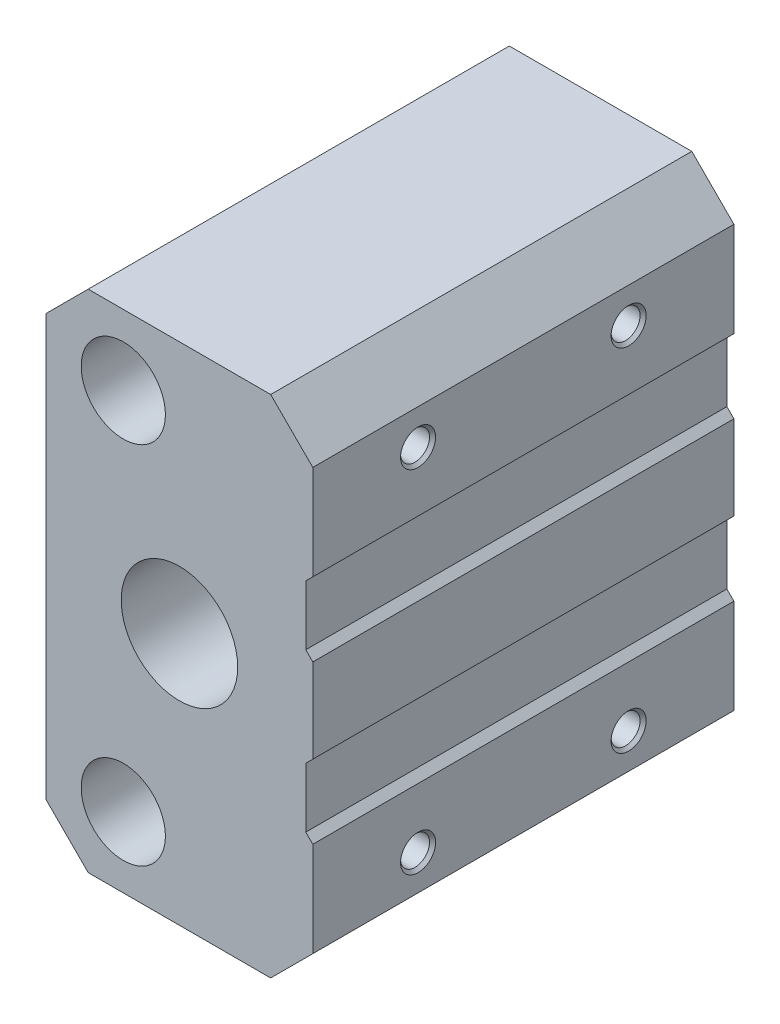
ISO-10303-21;
HEADER;
FILE_DESCRIPTION(('STEP AP214'),'2;1');
FILE_NAME('part.step','',(''),(''),'','','');
FILE_SCHEMA(('AUTOMOTIVE_DESIGN { 1 0 10303 214 1 1 1 1 }'));
ENDSEC;
DATA;
#1=APPLICATION_CONTEXT('core data for automotive mechanical design processes');
#2=APPLICATION_PROTOCOL_DEFINITION('international standard','automotive_design',2000,#1);
#3=PRODUCT_CONTEXT('',#1,'mechanical');
#4=PRODUCT('Part','Part','',(#3));
#5=PRODUCT_RELATED_PRODUCT_CATEGORY('part','',(#4));
#6=PRODUCT_DEFINITION_FORMATION('','',#4);
#7=PRODUCT_DEFINITION_CONTEXT('part definition',#1,'design');
#8=PRODUCT_DEFINITION('design','',#6,#7);
#9=PRODUCT_DEFINITION_SHAPE('','',#8);
#10=(LENGTH_UNIT() NAMED_UNIT(*) SI_UNIT(.MILLI.,.METRE.));
#11=(NAMED_UNIT(*) PLANE_ANGLE_UNIT() SI_UNIT($,.RADIAN.));
#12=(NAMED_UNIT(*) SI_UNIT($,.STERADIAN.) SOLID_ANGLE_UNIT());
#13=UNCERTAINTY_MEASURE_WITH_UNIT(LENGTH_MEASURE(1.E-05),#10,'distance_accuracy_value','');
#14=(GEOMETRIC_REPRESENTATION_CONTEXT(3) GLOBAL_UNCERTAINTY_ASSIGNED_CONTEXT((#13)) GLOBAL_UNIT_ASSIGNED_CONTEXT((#10,
#11,#12)) REPRESENTATION_CONTEXT('',''));
#15=CARTESIAN_POINT('',(0.,0.,0.));
#16=DIRECTION('',(0.,0.,1.));
#17=DIRECTION('',(1.,0.,0.));
#18=AXIS2_PLACEMENT_3D('',#15,#16,#17);
#19=CARTESIAN_POINT('',(10.9999999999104,-25.,-15.));
#20=DIRECTION('',(1.,0.,0.));
#21=DIRECTION('',(0.,0.,-1.));
#22=AXIS2_PLACEMENT_3D('',#19,#20,#21);
#23=CONICAL_SURFACE('',#22,2.06699999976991,1.04719755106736);
#24=CARTESIAN_POINT('',(9.80661699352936,-25.,-15.0000000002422));
#25=VERTEX_POINT('',#24);
#26=VERTEX_LOOP('',#25);
#27=FACE_BOUND('',#26,.T.);
#28=CARTESIAN_POINT('',(10.9999999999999,-25.,-15.));
#29=DIRECTION('',(-1.,0.,0.));
#30=DIRECTION('',(0.,0.,1.));
#31=AXIS2_PLACEMENT_3D('',#28,#29,#30);
#32=CIRCLE('',#31,2.067);
#33=CARTESIAN_POINT('',(10.9999999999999,-25.,-12.933));
#34=VERTEX_POINT('',#33);
#35=EDGE_CURVE('E144',#34,#34,#32,.F.);
#36=ORIENTED_EDGE('',*,*,#35,.T.);
#37=EDGE_LOOP('',(#36));
#38=FACE_BOUND('',#37,.T.);
#39=ADVANCED_FACE('F17',(#27,#38),#23,.F.);
#40=CARTESIAN_POINT('',(11.0000000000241,-25.,-45.));
#41=DIRECTION('',(1.,0.,0.));
#42=DIRECTION('',(0.,0.,-1.));
#43=AXIS2_PLACEMENT_3D('',#40,#41,#42);
#44=CONICAL_SURFACE('',#43,2.06699999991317,1.04719755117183);
#45=CARTESIAN_POINT('',(9.80661699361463,-25.,-44.9999999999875));
#46=VERTEX_POINT('',#45);
#47=VERTEX_LOOP('',#46);
#48=FACE_BOUND('',#47,.T.);
#49=CARTESIAN_POINT('',(10.9999999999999,-25.,-45.));
#50=DIRECTION('',(-1.,0.,0.));
#51=DIRECTION('',(0.,0.,1.));
#52=AXIS2_PLACEMENT_3D('',#49,#50,#51);
#53=CIRCLE('',#52,2.067);
#54=CARTESIAN_POINT('',(10.9999999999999,-25.,-42.933));
#55=VERTEX_POINT('',#54);
#56=EDGE_CURVE('E146',#55,#55,#53,.F.);
#57=ORIENTED_EDGE('',*,*,#56,.T.);
#58=EDGE_LOOP('',(#57));
#59=FACE_BOUND('',#58,.T.);
#60=ADVANCED_FACE('F141',(#48,#59),#44,.F.);
#61=CARTESIAN_POINT('',(11.0000000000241,25.,-15.));
#62=DIRECTION('',(1.,0.,0.));
#63=DIRECTION('',(0.,0.,-1.));
#64=AXIS2_PLACEMENT_3D('',#61,#62,#63);
#65=CONICAL_SURFACE('',#64,2.06699999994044,1.04719755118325);
#66=CARTESIAN_POINT('',(9.80661699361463,25.,-14.9999999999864));
#67=VERTEX_POINT('',#66);
#68=VERTEX_LOOP('',#67);
#69=FACE_BOUND('',#68,.T.);
#70=CARTESIAN_POINT('',(10.9999999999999,25.,-15.));
#71=DIRECTION('',(-1.,0.,0.));
#72=DIRECTION('',(0.,0.,1.));
#73=AXIS2_PLACEMENT_3D('',#70,#71,#72);
#74=CIRCLE('',#73,2.067);
#75=CARTESIAN_POINT('',(10.9999999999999,25.,-12.933));
#76=VERTEX_POINT('',#75);
#77=EDGE_CURVE('E149',#76,#76,#74,.F.);
#78=ORIENTED_EDGE('',*,*,#77,.T.);
#79=EDGE_LOOP('',(#78));
#80=FACE_BOUND('',#79,.T.);
#81=ADVANCED_FACE('F237',(#69,#80),#65,.F.);
#82=CARTESIAN_POINT('',(11.0000000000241,25.,-45.));
#83=DIRECTION('',(1.,0.,0.));
#84=DIRECTION('',(0.,0.,-1.));
#85=AXIS2_PLACEMENT_3D('',#82,#83,#84);
#86=CONICAL_SURFACE('',#85,2.06699999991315,1.04719755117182);
#87=CARTESIAN_POINT('',(9.80661699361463,25.,-44.9999999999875));
#88=VERTEX_POINT('',#87);
#89=VERTEX_LOOP('',#88);
#90=FACE_BOUND('',#89,.T.);
#91=CARTESIAN_POINT('',(10.9999999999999,25.,-45.));
#92=DIRECTION('',(-1.,0.,0.));
#93=DIRECTION('',(0.,0.,1.));
#94=AXIS2_PLACEMENT_3D('',#91,#92,#93);
#95=CIRCLE('',#94,2.067);
#96=CARTESIAN_POINT('',(10.9999999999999,25.,-42.933));
#97=VERTEX_POINT('',#96);
#98=EDGE_CURVE('E232',#97,#97,#95,.F.);
#99=ORIENTED_EDGE('',*,*,#98,.T.);
#100=EDGE_LOOP('',(#99));
#101=FACE_BOUND('',#100,.T.);
#102=ADVANCED_FACE('F365',(#90,#101),#86,.F.);
#103=CARTESIAN_POINT('',(19.,-25.,-15.));
#104=DIRECTION('',(-1.,0.,0.));
#105=DIRECTION('',(0.,0.,1.));
#106=AXIS2_PLACEMENT_3D('',#103,#104,#105);
#107=CYLINDRICAL_SURFACE('',#106,2.067);
#108=CARTESIAN_POINT('',(18.5669999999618,-25.,-15.));
#109=DIRECTION('',(1.,0.,0.));
#110=DIRECTION('',(0.,0.,-1.));
#111=AXIS2_PLACEMENT_3D('',#108,#109,#110);
#112=CIRCLE('',#111,2.06699999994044);
#113=CARTESIAN_POINT('',(18.5669999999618,-25.,-17.0669999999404));
#114=VERTEX_POINT('',#113);
#115=EDGE_CURVE('E229',#114,#114,#112,.T.);
#116=ORIENTED_EDGE('',*,*,#115,.T.);
#117=EDGE_LOOP('',(#116));
#118=FACE_BOUND('',#117,.T.);
#119=ORIENTED_EDGE('',*,*,#35,.F.);
#120=EDGE_LOOP('',(#119));
#121=FACE_BOUND('',#120,.T.);
#122=ADVANCED_FACE('F253',(#118,#121),#107,.F.);
#123=CARTESIAN_POINT('',(19.,-25.,-45.));
#124=DIRECTION('',(-1.,0.,0.));
#125=DIRECTION('',(0.,0.,1.));
#126=AXIS2_PLACEMENT_3D('',#123,#124,#125);
#127=CYLINDRICAL_SURFACE('',#126,2.067);
#128=CARTESIAN_POINT('',(18.5669999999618,-25.,-45.));
#129=DIRECTION('',(1.,0.,0.));
#130=DIRECTION('',(0.,0.,-1.));
#131=AXIS2_PLACEMENT_3D('',#128,#129,#130);
#132=CIRCLE('',#131,2.06699999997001);
#133=CARTESIAN_POINT('',(18.5669999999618,-25.,-47.06699999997));
#134=VERTEX_POINT('',#133);
#135=EDGE_CURVE('E222',#134,#134,#132,.T.);
#136=ORIENTED_EDGE('',*,*,#135,.T.);
#137=EDGE_LOOP('',(#136));
#138=FACE_BOUND('',#137,.T.);
#139=ORIENTED_EDGE('',*,*,#56,.F.);
#140=EDGE_LOOP('',(#139));
#141=FACE_BOUND('',#140,.T.);
#142=ADVANCED_FACE('F242',(#138,#141),#127,.F.);
#143=CARTESIAN_POINT('',(19.,25.,-15.));
#144=DIRECTION('',(-1.,0.,0.));
#145=DIRECTION('',(0.,0.,1.));
#146=AXIS2_PLACEMENT_3D('',#143,#144,#145);
#147=CYLINDRICAL_SURFACE('',#146,2.067);
#148=CARTESIAN_POINT('',(18.5669999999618,25.,-15.));
#149=DIRECTION('',(1.,0.,0.));
#150=DIRECTION('',(0.,0.,-1.));
#151=AXIS2_PLACEMENT_3D('',#148,#149,#150);
#152=CIRCLE('',#151,2.06699999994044);
#153=CARTESIAN_POINT('',(18.5669999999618,25.,-17.0669999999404));
#154=VERTEX_POINT('',#153);
#155=EDGE_CURVE('E209',#154,#154,#152,.T.);
#156=ORIENTED_EDGE('',*,*,#155,.T.);
#157=EDGE_LOOP('',(#156));
#158=FACE_BOUND('',#157,.T.);
#159=ORIENTED_EDGE('',*,*,#77,.F.);
#160=EDGE_LOOP('',(#159));
#161=FACE_BOUND('',#160,.T.);
#162=ADVANCED_FACE('F239',(#158,#161),#147,.F.);
#163=CARTESIAN_POINT('',(19.,25.,-45.));
#164=DIRECTION('',(-1.,0.,0.));
#165=DIRECTION('',(0.,0.,1.));
#166=AXIS2_PLACEMENT_3D('',#163,#164,#165);
#167=CYLINDRICAL_SURFACE('',#166,2.067);
#168=CARTESIAN_POINT('',(18.5669999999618,25.,-45.));
#169=DIRECTION('',(1.,0.,0.));
#170=DIRECTION('',(0.,0.,-1.));
#171=AXIS2_PLACEMENT_3D('',#168,#169,#170);
#172=CIRCLE('',#171,2.06699999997);
#173=CARTESIAN_POINT('',(18.5669999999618,25.,-47.06699999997));
#174=VERTEX_POINT('',#173);
#175=EDGE_CURVE('E206',#174,#174,#172,.T.);
#176=ORIENTED_EDGE('',*,*,#175,.T.);
#177=EDGE_LOOP('',(#176));
#178=FACE_BOUND('',#177,.T.);
#179=ORIENTED_EDGE('',*,*,#98,.F.);
#180=EDGE_LOOP('',(#179));
#181=FACE_BOUND('',#180,.T.);
#182=ADVANCED_FACE('F241',(#178,#181),#167,.F.);
#183=CARTESIAN_POINT('',(19.0000000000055,-25.,-15.));
#184=DIRECTION('',(1.,0.,0.));
#185=DIRECTION('',(0.,0.,-1.));
#186=AXIS2_PLACEMENT_3D('',#183,#184,#185);
#187=CONICAL_SURFACE('',#186,2.49999999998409,0.785398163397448);
#188=ORIENTED_EDGE('',*,*,#115,.F.);
#189=EDGE_LOOP('',(#188));
#190=FACE_BOUND('',#189,.T.);
#191=CARTESIAN_POINT('',(19.0000000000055,-25.,-15.));
#192=DIRECTION('',(1.,0.,0.));
#193=DIRECTION('',(0.,0.,-1.));
#194=AXIS2_PLACEMENT_3D('',#191,#192,#193);
#195=CIRCLE('',#194,2.49999999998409);
#196=CARTESIAN_POINT('',(19.0000000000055,-25.,-17.4999999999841));
#197=VERTEX_POINT('',#196);
#198=EDGE_CURVE('E20',#197,#197,#195,.F.);
#199=ORIENTED_EDGE('',*,*,#198,.F.);
#200=EDGE_LOOP('',(#199));
#201=FACE_BOUND('',#200,.T.);
#202=ADVANCED_FACE('F250',(#190,#201),#187,.F.);
#203=CARTESIAN_POINT('',(19.0000000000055,-25.,-45.));
#204=DIRECTION('',(1.,0.,0.));
#205=DIRECTION('',(0.,0.,-1.));
#206=AXIS2_PLACEMENT_3D('',#203,#204,#205);
#207=CONICAL_SURFACE('',#206,2.50000000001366,0.785398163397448);
#208=ORIENTED_EDGE('',*,*,#135,.F.);
#209=EDGE_LOOP('',(#208));
#210=FACE_BOUND('',#209,.T.);
#211=CARTESIAN_POINT('',(19.0000000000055,-25.,-45.));
#212=DIRECTION('',(1.,0.,0.));
#213=DIRECTION('',(0.,0.,-1.));
#214=AXIS2_PLACEMENT_3D('',#211,#212,#213);
#215=CIRCLE('',#214,2.50000000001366);
#216=CARTESIAN_POINT('',(19.0000000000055,-25.,-47.5000000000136));
#217=VERTEX_POINT('',#216);
#218=EDGE_CURVE('E183',#217,#217,#215,.F.);
#219=ORIENTED_EDGE('',*,*,#218,.F.);
#220=EDGE_LOOP('',(#219));
#221=FACE_BOUND('',#220,.T.);
#222=ADVANCED_FACE('F349',(#210,#221),#207,.F.);
#223=CARTESIAN_POINT('',(19.,-16.5,-60.));
#224=DIRECTION('',(0.707106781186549,0.707106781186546,0.));
#225=DIRECTION('',(-0.707106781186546,0.707106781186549,0.));
#226=AXIS2_PLACEMENT_3D('',#223,#224,#225);
#227=PLANE('',#226);
#228=DIRECTION('',(-0.707106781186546,0.707106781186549,0.));
#229=VECTOR('',#228,1.);
#230=CARTESIAN_POINT('',(19.,-16.5,-60.));
#231=LINE('',#230,#229);
#232=CARTESIAN_POINT('',(19.,-16.5,-60.));
#233=VERTEX_POINT('',#232);
#234=CARTESIAN_POINT('',(18.,-15.5,-60.));
#235=VERTEX_POINT('',#234);
#236=EDGE_CURVE('E218',#233,#235,#231,.T.);
#237=ORIENTED_EDGE('',*,*,#236,.T.);
#238=DIRECTION('',(0.,0.,-1.));
#239=VECTOR('',#238,1.);
#240=CARTESIAN_POINT('',(18.,-15.5,-60.));
#241=LINE('',#240,#239);
#242=CARTESIAN_POINT('',(18.,-15.5,0.));
#243=VERTEX_POINT('',#242);
#244=EDGE_CURVE('E185',#243,#235,#241,.T.);
#245=ORIENTED_EDGE('',*,*,#244,.F.);
#246=DIRECTION('',(-0.707106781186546,0.707106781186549,0.));
#247=VECTOR('',#246,1.);
#248=CARTESIAN_POINT('',(19.,-16.5,0.));
#249=LINE('',#248,#247);
#250=CARTESIAN_POINT('',(19.,-16.5,0.));
#251=VERTEX_POINT('',#250);
#252=EDGE_CURVE('E220',#243,#251,#249,.F.);
#253=ORIENTED_EDGE('',*,*,#252,.T.);
#254=DIRECTION('',(0.,0.,-1.));
#255=VECTOR('',#254,1.);
#256=CARTESIAN_POINT('',(19.,-16.5,-60.));
#257=LINE('',#256,#255);
#258=EDGE_CURVE('E186',#233,#251,#257,.F.);
#259=ORIENTED_EDGE('',*,*,#258,.F.);
#260=EDGE_LOOP('',(#237,#245,#253,#259));
#261=FACE_BOUND('',#260,.T.);
#262=ADVANCED_FACE('F345',(#261),#227,.T.);
#263=CARTESIAN_POINT('',(18.,-7.,-60.));
#264=DIRECTION('',(0.707106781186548,-0.707106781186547,0.));
#265=DIRECTION('',(0.707106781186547,0.707106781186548,0.));
#266=AXIS2_PLACEMENT_3D('',#263,#264,#265);
#267=PLANE('',#266);
#268=DIRECTION('',(0.707106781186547,0.707106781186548,0.));
#269=VECTOR('',#268,1.);
#270=CARTESIAN_POINT('',(18.,-7.,-60.));
#271=LINE('',#270,#269);
#272=CARTESIAN_POINT('',(18.,-7.,-60.));
#273=VERTEX_POINT('',#272);
#274=CARTESIAN_POINT('',(19.,-6.,-60.));
#275=VERTEX_POINT('',#274);
#276=EDGE_CURVE('E214',#273,#275,#271,.T.);
#277=ORIENTED_EDGE('',*,*,#276,.T.);
#278=DIRECTION('',(0.,0.,-1.));
#279=VECTOR('',#278,1.);
#280=CARTESIAN_POINT('',(19.,-6.,-60.));
#281=LINE('',#280,#279);
#282=CARTESIAN_POINT('',(19.,-6.,0.));
#283=VERTEX_POINT('',#282);
#284=EDGE_CURVE('E685',#283,#275,#281,.T.);
#285=ORIENTED_EDGE('',*,*,#284,.F.);
#286=DIRECTION('',(0.707106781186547,0.707106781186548,0.));
#287=VECTOR('',#286,1.);
#288=CARTESIAN_POINT('',(18.,-7.,0.));
#289=LINE('',#288,#287);
#290=CARTESIAN_POINT('',(18.,-7.,0.));
#291=VERTEX_POINT('',#290);
#292=EDGE_CURVE('E216',#283,#291,#289,.F.);
#293=ORIENTED_EDGE('',*,*,#292,.T.);
#294=DIRECTION('',(0.,0.,-1.));
#295=VECTOR('',#294,1.);
#296=CARTESIAN_POINT('',(18.,-7.,-60.));
#297=LINE('',#296,#295);
#298=EDGE_CURVE('E190',#273,#291,#297,.F.);
#299=ORIENTED_EDGE('',*,*,#298,.F.);
#300=EDGE_LOOP('',(#277,#285,#293,#299));
#301=FACE_BOUND('',#300,.T.);
#302=ADVANCED_FACE('F341',(#301),#267,.T.);
#303=CARTESIAN_POINT('',(19.,6.,-60.));
#304=DIRECTION('',(0.707106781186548,0.707106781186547,0.));
#305=DIRECTION('',(-0.707106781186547,0.707106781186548,0.));
#306=AXIS2_PLACEMENT_3D('',#303,#304,#305);
#307=PLANE('',#306);
#308=DIRECTION('',(-0.707106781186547,0.707106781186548,0.));
#309=VECTOR('',#308,1.);
#310=CARTESIAN_POINT('',(19.,6.,-60.));
#311=LINE('',#310,#309);
#312=CARTESIAN_POINT('',(19.,6.,-60.));
#313=VERTEX_POINT('',#312);
#314=CARTESIAN_POINT('',(18.,7.,-60.));
#315=VERTEX_POINT('',#314);
#316=EDGE_CURVE('E210',#313,#315,#311,.T.);
#317=ORIENTED_EDGE('',*,*,#316,.T.);
#318=DIRECTION('',(0.,0.,-1.));
#319=VECTOR('',#318,1.);
#320=CARTESIAN_POINT('',(18.,7.,-60.));
#321=LINE('',#320,#319);
#322=CARTESIAN_POINT('',(18.,7.,0.));
#323=VERTEX_POINT('',#322);
#324=EDGE_CURVE('E679',#323,#315,#321,.T.);
#325=ORIENTED_EDGE('',*,*,#324,.F.);
#326=DIRECTION('',(-0.707106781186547,0.707106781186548,0.));
#327=VECTOR('',#326,1.);
#328=CARTESIAN_POINT('',(19.,6.,0.));
#329=LINE('',#328,#327);
#330=CARTESIAN_POINT('',(19.,6.,0.));
#331=VERTEX_POINT('',#330);
#332=EDGE_CURVE('E212',#323,#331,#329,.F.);
#333=ORIENTED_EDGE('',*,*,#332,.T.);
#334=DIRECTION('',(0.,0.,-1.));
#335=VECTOR('',#334,1.);
#336=CARTESIAN_POINT('',(19.,6.,-60.));
#337=LINE('',#336,#335);
#338=EDGE_CURVE('E682',#313,#331,#337,.F.);
#339=ORIENTED_EDGE('',*,*,#338,.F.);
#340=EDGE_LOOP('',(#317,#325,#333,#339));
#341=FACE_BOUND('',#340,.T.);
#342=ADVANCED_FACE('F337',(#341),#307,.T.);
#343=CARTESIAN_POINT('',(18.9999999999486,25.,-15.));
#344=DIRECTION('',(1.,0.,0.));
#345=DIRECTION('',(0.,0.,-1.));
#346=AXIS2_PLACEMENT_3D('',#343,#344,#345);
#347=CONICAL_SURFACE('',#346,2.49999999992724,0.785398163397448);
#348=ORIENTED_EDGE('',*,*,#155,.F.);
#349=EDGE_LOOP('',(#348));
#350=FACE_BOUND('',#349,.T.);
#351=CARTESIAN_POINT('',(19.0000000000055,25.,-15.));
#352=DIRECTION('',(1.,0.,0.));
#353=DIRECTION('',(0.,0.,-1.));
#354=AXIS2_PLACEMENT_3D('',#351,#352,#353);
#355=CIRCLE('',#354,2.49999999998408);
#356=CARTESIAN_POINT('',(19.0000000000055,25.,-17.4999999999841));
#357=VERTEX_POINT('',#356);
#358=EDGE_CURVE('E180',#357,#357,#355,.F.);
#359=ORIENTED_EDGE('',*,*,#358,.F.);
#360=EDGE_LOOP('',(#359));
#361=FACE_BOUND('',#360,.T.);
#362=ADVANCED_FACE('F333',(#350,#361),#347,.F.);
#363=CARTESIAN_POINT('',(18.,15.5,-60.));
#364=DIRECTION('',(0.707106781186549,-0.707106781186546,0.));
#365=DIRECTION('',(0.707106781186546,0.707106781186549,0.));
#366=AXIS2_PLACEMENT_3D('',#363,#364,#365);
#367=PLANE('',#366);
#368=DIRECTION('',(0.707106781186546,0.707106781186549,0.));
#369=VECTOR('',#368,1.);
#370=CARTESIAN_POINT('',(18.,15.5,-60.));
#371=LINE('',#370,#369);
#372=CARTESIAN_POINT('',(18.,15.5,-60.));
#373=VERTEX_POINT('',#372);
#374=CARTESIAN_POINT('',(19.,16.5,-60.));
#375=VERTEX_POINT('',#374);
#376=EDGE_CURVE('E204',#373,#375,#371,.T.);
#377=ORIENTED_EDGE('',*,*,#376,.T.);
#378=DIRECTION('',(0.,0.,-1.));
#379=VECTOR('',#378,1.);
#380=CARTESIAN_POINT('',(19.,16.5,-60.));
#381=LINE('',#380,#379);
#382=CARTESIAN_POINT('',(19.,16.5,0.));
#383=VERTEX_POINT('',#382);
#384=EDGE_CURVE('E179',#383,#375,#381,.T.);
#385=ORIENTED_EDGE('',*,*,#384,.F.);
#386=DIRECTION('',(0.707106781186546,0.707106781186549,0.));
#387=VECTOR('',#386,1.);
#388=CARTESIAN_POINT('',(18.,15.5,0.));
#389=LINE('',#388,#387);
#390=CARTESIAN_POINT('',(18.,15.5,0.));
#391=VERTEX_POINT('',#390);
#392=EDGE_CURVE('E207',#383,#391,#389,.F.);
#393=ORIENTED_EDGE('',*,*,#392,.T.);
#394=DIRECTION('',(0.,0.,-1.));
#395=VECTOR('',#394,1.);
#396=CARTESIAN_POINT('',(18.,15.5,-60.));
#397=LINE('',#396,#395);
#398=EDGE_CURVE('E182',#373,#391,#397,.F.);
#399=ORIENTED_EDGE('',*,*,#398,.F.);
#400=EDGE_LOOP('',(#377,#385,#393,#399));
#401=FACE_BOUND('',#400,.T.);
#402=ADVANCED_FACE('F329',(#401),#367,.T.);
#403=CARTESIAN_POINT('',(19.0000000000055,25.,-45.));
#404=DIRECTION('',(1.,0.,0.));
#405=DIRECTION('',(0.,0.,-1.));
#406=AXIS2_PLACEMENT_3D('',#403,#404,#405);
#407=CONICAL_SURFACE('',#406,2.50000000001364,0.785398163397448);
#408=ORIENTED_EDGE('',*,*,#175,.F.);
#409=EDGE_LOOP('',(#408));
#410=FACE_BOUND('',#409,.T.);
#411=CARTESIAN_POINT('',(19.0000000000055,25.,-45.));
#412=DIRECTION('',(1.,0.,0.));
#413=DIRECTION('',(0.,0.,-1.));
#414=AXIS2_PLACEMENT_3D('',#411,#412,#413);
#415=CIRCLE('',#414,2.50000000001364);
#416=CARTESIAN_POINT('',(19.0000000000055,25.,-47.5000000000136));
#417=VERTEX_POINT('',#416);
#418=EDGE_CURVE('E175',#417,#417,#415,.F.);
#419=ORIENTED_EDGE('',*,*,#418,.F.);
#420=EDGE_LOOP('',(#419));
#421=FACE_BOUND('',#420,.T.);
#422=ADVANCED_FACE('F325',(#410,#421),#407,.F.);
#423=CARTESIAN_POINT('',(-8.,26.,-60.));
#424=DIRECTION('',(0.,0.,1.));
#425=DIRECTION('',(1.,0.,0.));
#426=AXIS2_PLACEMENT_3D('',#423,#424,#425);
#427=CYLINDRICAL_SURFACE('',#426,6.);
#428=CARTESIAN_POINT('',(-8.,26.,-60.));
#429=DIRECTION('',(0.,0.,1.));
#430=DIRECTION('',(1.,0.,0.));
#431=AXIS2_PLACEMENT_3D('',#428,#429,#430);
#432=CIRCLE('',#431,6.);
#433=CARTESIAN_POINT('',(-2.,26.,-60.));
#434=VERTEX_POINT('',#433);
#435=EDGE_CURVE('E160',#434,#434,#432,.F.);
#436=ORIENTED_EDGE('',*,*,#435,.T.);
#437=EDGE_LOOP('',(#436));
#438=FACE_BOUND('',#437,.T.);
#439=CARTESIAN_POINT('',(-8.,26.,0.));
#440=DIRECTION('',(0.,0.,1.));
#441=DIRECTION('',(1.,0.,0.));
#442=AXIS2_PLACEMENT_3D('',#439,#440,#441);
#443=CIRCLE('',#442,6.);
#444=CARTESIAN_POINT('',(-2.,26.,0.));
#445=VERTEX_POINT('',#444);
#446=EDGE_CURVE('E171',#445,#445,#443,.F.);
#447=ORIENTED_EDGE('',*,*,#446,.F.);
#448=EDGE_LOOP('',(#447));
#449=FACE_BOUND('',#448,.T.);
#450=ADVANCED_FACE('F321',(#438,#449),#427,.F.);
#451=CARTESIAN_POINT('',(-8.,-26.,-60.));
#452=DIRECTION('',(0.,0.,1.));
#453=DIRECTION('',(1.,0.,0.));
#454=AXIS2_PLACEMENT_3D('',#451,#452,#453);
#455=CYLINDRICAL_SURFACE('',#454,6.);
#456=CARTESIAN_POINT('',(-8.,-26.,-60.));
#457=DIRECTION('',(0.,0.,1.));
#458=DIRECTION('',(1.,0.,0.));
#459=AXIS2_PLACEMENT_3D('',#456,#457,#458);
#460=CIRCLE('',#459,6.);
#461=CARTESIAN_POINT('',(-2.,-26.,-60.));
#462=VERTEX_POINT('',#461);
#463=EDGE_CURVE('E157',#462,#462,#460,.F.);
#464=ORIENTED_EDGE('',*,*,#463,.T.);
#465=EDGE_LOOP('',(#464));
#466=FACE_BOUND('',#465,.T.);
#467=CARTESIAN_POINT('',(-8.,-26.,0.));
#468=DIRECTION('',(0.,0.,1.));
#469=DIRECTION('',(1.,0.,0.));
#470=AXIS2_PLACEMENT_3D('',#467,#468,#469);
#471=CIRCLE('',#470,6.);
#472=CARTESIAN_POINT('',(-2.,-26.,0.));
#473=VERTEX_POINT('',#472);
#474=EDGE_CURVE('E168',#473,#473,#471,.F.);
#475=ORIENTED_EDGE('',*,*,#474,.F.);
#476=EDGE_LOOP('',(#475));
#477=FACE_BOUND('',#476,.T.);
#478=ADVANCED_FACE('F317',(#466,#477),#455,.F.);
#479=CARTESIAN_POINT('',(0.,0.,-60.));
#480=DIRECTION('',(0.,0.,1.));
#481=DIRECTION('',(1.,0.,0.));
#482=AXIS2_PLACEMENT_3D('',#479,#480,#481);
#483=CYLINDRICAL_SURFACE('',#482,8.3);
#484=CARTESIAN_POINT('',(0.,0.,-60.));
#485=DIRECTION('',(0.,0.,1.));
#486=DIRECTION('',(1.,0.,0.));
#487=AXIS2_PLACEMENT_3D('',#484,#485,#486);
#488=CIRCLE('',#487,8.3);
#489=CARTESIAN_POINT('',(8.3,0.,-60.));
#490=VERTEX_POINT('',#489);
#491=EDGE_CURVE('E153',#490,#490,#488,.F.);
#492=ORIENTED_EDGE('',*,*,#491,.T.);
#493=EDGE_LOOP('',(#492));
#494=FACE_BOUND('',#493,.T.);
#495=CARTESIAN_POINT('',(0.,0.,0.));
#496=DIRECTION('',(0.,0.,1.));
#497=DIRECTION('',(1.,0.,0.));
#498=AXIS2_PLACEMENT_3D('',#495,#496,#497);
#499=CIRCLE('',#498,8.3);
#500=CARTESIAN_POINT('',(8.3,0.,0.));
#501=VERTEX_POINT('',#500);
#502=EDGE_CURVE('E164',#501,#501,#499,.F.);
#503=ORIENTED_EDGE('',*,*,#502,.F.);
#504=EDGE_LOOP('',(#503));
#505=FACE_BOUND('',#504,.T.);
#506=ADVANCED_FACE('F313',(#494,#505),#483,.F.);
#507=CARTESIAN_POINT('',(13.,-36.,-60.));
#508=DIRECTION('',(0.707106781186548,-0.707106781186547,0.));
#509=DIRECTION('',(0.707106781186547,0.707106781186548,0.));
#510=AXIS2_PLACEMENT_3D('',#507,#508,#509);
#511=PLANE('',#510);
#512=DIRECTION('',(0.707106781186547,0.707106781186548,0.));
#513=VECTOR('',#512,1.);
#514=CARTESIAN_POINT('',(13.,-36.,-60.));
#515=LINE('',#514,#513);
#516=CARTESIAN_POINT('',(13.,-36.,-60.));
#517=VERTEX_POINT('',#516);
#518=CARTESIAN_POINT('',(19.,-30.,-60.));
#519=VERTEX_POINT('',#518);
#520=EDGE_CURVE('E635',#517,#519,#515,.T.);
#521=ORIENTED_EDGE('',*,*,#520,.T.);
#522=DIRECTION('',(0.,0.,-1.));
#523=VECTOR('',#522,1.);
#524=CARTESIAN_POINT('',(19.,-30.,-60.));
#525=LINE('',#524,#523);
#526=CARTESIAN_POINT('',(19.,-30.,0.));
#527=VERTEX_POINT('',#526);
#528=EDGE_CURVE('E193',#527,#519,#525,.T.);
#529=ORIENTED_EDGE('',*,*,#528,.F.);
#530=DIRECTION('',(0.707106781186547,0.707106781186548,0.));
#531=VECTOR('',#530,1.);
#532=CARTESIAN_POINT('',(13.,-36.,0.));
#533=LINE('',#532,#531);
#534=CARTESIAN_POINT('',(13.,-36.,0.));
#535=VERTEX_POINT('',#534);
#536=EDGE_CURVE('E664',#535,#527,#533,.T.);
#537=ORIENTED_EDGE('',*,*,#536,.F.);
#538=DIRECTION('',(0.,0.,-1.));
#539=VECTOR('',#538,1.);
#540=CARTESIAN_POINT('',(13.,-36.,-60.));
#541=LINE('',#540,#539);
#542=EDGE_CURVE('E174',#517,#535,#541,.F.);
#543=ORIENTED_EDGE('',*,*,#542,.F.);
#544=EDGE_LOOP('',(#521,#529,#537,#543));
#545=FACE_BOUND('',#544,.T.);
#546=ADVANCED_FACE('F310',(#545),#511,.T.);
#547=CARTESIAN_POINT('',(19.,-30.,-60.));
#548=DIRECTION('',(1.,0.,0.));
#549=DIRECTION('',(0.,0.,-1.));
#550=AXIS2_PLACEMENT_3D('',#547,#548,#549);
#551=PLANE('',#550);
#552=ORIENTED_EDGE('',*,*,#218,.T.);
#553=EDGE_LOOP('',(#552));
#554=FACE_BOUND('',#553,.T.);
#555=DIRECTION('',(0.,1.,0.));
#556=VECTOR('',#555,1.);
#557=CARTESIAN_POINT('',(19.,0.,-60.));
#558=LINE('',#557,#556);
#559=EDGE_CURVE('E630',#519,#233,#558,.T.);
#560=ORIENTED_EDGE('',*,*,#559,.T.);
#561=ORIENTED_EDGE('',*,*,#258,.T.);
#562=DIRECTION('',(0.,1.,0.));
#563=VECTOR('',#562,1.);
#564=CARTESIAN_POINT('',(19.,0.,0.));
#565=LINE('',#564,#563);
#566=EDGE_CURVE('E662',#527,#251,#565,.T.);
#567=ORIENTED_EDGE('',*,*,#566,.F.);
#568=ORIENTED_EDGE('',*,*,#528,.T.);
#569=EDGE_LOOP('',(#560,#561,#567,#568));
#570=FACE_BOUND('',#569,.T.);
#571=ORIENTED_EDGE('',*,*,#198,.T.);
#572=EDGE_LOOP('',(#571));
#573=FACE_BOUND('',#572,.T.);
#574=ADVANCED_FACE('F306',(#554,#570,#573),#551,.T.);
#575=CARTESIAN_POINT('',(18.,-15.5,-60.));
#576=DIRECTION('',(1.,0.,0.));
#577=DIRECTION('',(0.,0.,-1.));
#578=AXIS2_PLACEMENT_3D('',#575,#576,#577);
#579=PLANE('',#578);
#580=DIRECTION('',(0.,1.,0.));
#581=VECTOR('',#580,1.);
#582=CARTESIAN_POINT('',(18.,0.,-60.));
#583=LINE('',#582,#581);
#584=EDGE_CURVE('E622',#235,#273,#583,.T.);
#585=ORIENTED_EDGE('',*,*,#584,.T.);
#586=ORIENTED_EDGE('',*,*,#298,.T.);
#587=DIRECTION('',(0.,1.,0.));
#588=VECTOR('',#587,1.);
#589=CARTESIAN_POINT('',(18.,0.,0.));
#590=LINE('',#589,#588);
#591=EDGE_CURVE('E624',#243,#291,#590,.T.);
#592=ORIENTED_EDGE('',*,*,#591,.F.);
#593=ORIENTED_EDGE('',*,*,#244,.T.);
#594=EDGE_LOOP('',(#585,#586,#592,#593));
#595=FACE_BOUND('',#594,.T.);
#596=ADVANCED_FACE('F302',(#595),#579,.T.);
#597=CARTESIAN_POINT('',(19.,-6.,-60.));
#598=DIRECTION('',(1.,0.,0.));
#599=DIRECTION('',(0.,0.,-1.));
#600=AXIS2_PLACEMENT_3D('',#597,#598,#599);
#601=PLANE('',#600);
#602=DIRECTION('',(0.,1.,0.));
#603=VECTOR('',#602,1.);
#604=CARTESIAN_POINT('',(19.,0.,-60.));
#605=LINE('',#604,#603);
#606=EDGE_CURVE('E629',#275,#313,#605,.T.);
#607=ORIENTED_EDGE('',*,*,#606,.T.);
#608=ORIENTED_EDGE('',*,*,#338,.T.);
#609=DIRECTION('',(0.,1.,0.));
#610=VECTOR('',#609,1.);
#611=CARTESIAN_POINT('',(19.,0.,0.));
#612=LINE('',#611,#610);
#613=EDGE_CURVE('E658',#283,#331,#612,.T.);
#614=ORIENTED_EDGE('',*,*,#613,.F.);
#615=ORIENTED_EDGE('',*,*,#284,.T.);
#616=EDGE_LOOP('',(#607,#608,#614,#615));
#617=FACE_BOUND('',#616,.T.);
#618=ADVANCED_FACE('F298',(#617),#601,.T.);
#619=CARTESIAN_POINT('',(18.,7.,-60.));
#620=DIRECTION('',(1.,0.,0.));
#621=DIRECTION('',(0.,0.,-1.));
#622=AXIS2_PLACEMENT_3D('',#619,#620,#621);
#623=PLANE('',#622);
#624=DIRECTION('',(0.,1.,0.));
#625=VECTOR('',#624,1.);
#626=CARTESIAN_POINT('',(18.,0.,-60.));
#627=LINE('',#626,#625);
#628=EDGE_CURVE('E633',#315,#373,#627,.T.);
#629=ORIENTED_EDGE('',*,*,#628,.T.);
#630=ORIENTED_EDGE('',*,*,#398,.T.);
#631=DIRECTION('',(0.,1.,0.));
#632=VECTOR('',#631,1.);
#633=CARTESIAN_POINT('',(18.,0.,0.));
#634=LINE('',#633,#632);
#635=EDGE_CURVE('E655',#323,#391,#634,.T.);
#636=ORIENTED_EDGE('',*,*,#635,.F.);
#637=ORIENTED_EDGE('',*,*,#324,.T.);
#638=EDGE_LOOP('',(#629,#630,#636,#637));
#639=FACE_BOUND('',#638,.T.);
#640=ADVANCED_FACE('F294',(#639),#623,.T.);
#641=CARTESIAN_POINT('',(19.,16.5,-60.));
#642=DIRECTION('',(1.,0.,0.));
#643=DIRECTION('',(0.,0.,-1.));
#644=AXIS2_PLACEMENT_3D('',#641,#642,#643);
#645=PLANE('',#644);
#646=ORIENTED_EDGE('',*,*,#418,.T.);
#647=EDGE_LOOP('',(#646));
#648=FACE_BOUND('',#647,.T.);
#649=DIRECTION('',(0.,1.,0.));
#650=VECTOR('',#649,1.);
#651=CARTESIAN_POINT('',(19.,0.,-60.));
#652=LINE('',#651,#650);
#653=CARTESIAN_POINT('',(19.,30.,-60.));
#654=VERTEX_POINT('',#653);
#655=EDGE_CURVE('E709',#375,#654,#652,.T.);
#656=ORIENTED_EDGE('',*,*,#655,.T.);
#657=DIRECTION('',(0.,0.,1.));
#658=VECTOR('',#657,1.);
#659=CARTESIAN_POINT('',(19.,30.,-60.));
#660=LINE('',#659,#658);
#661=CARTESIAN_POINT('',(19.,30.,0.));
#662=VERTEX_POINT('',#661);
#663=EDGE_CURVE('E178',#662,#654,#660,.F.);
#664=ORIENTED_EDGE('',*,*,#663,.F.);
#665=DIRECTION('',(0.,1.,0.));
#666=VECTOR('',#665,1.);
#667=CARTESIAN_POINT('',(19.,0.,0.));
#668=LINE('',#667,#666);
#669=EDGE_CURVE('E652',#383,#662,#668,.T.);
#670=ORIENTED_EDGE('',*,*,#669,.F.);
#671=ORIENTED_EDGE('',*,*,#384,.T.);
#672=EDGE_LOOP('',(#656,#664,#670,#671));
#673=FACE_BOUND('',#672,.T.);
#674=ORIENTED_EDGE('',*,*,#358,.T.);
#675=EDGE_LOOP('',(#674));
#676=FACE_BOUND('',#675,.T.);
#677=ADVANCED_FACE('F290',(#648,#673,#676),#645,.T.);
#678=CARTESIAN_POINT('',(19.,30.,-60.));
#679=DIRECTION('',(0.707106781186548,0.707106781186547,0.));
#680=DIRECTION('',(-0.707106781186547,0.707106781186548,0.));
#681=AXIS2_PLACEMENT_3D('',#678,#679,#680);
#682=PLANE('',#681);
#683=DIRECTION('',(-0.707106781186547,0.707106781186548,0.));
#684=VECTOR('',#683,1.);
#685=CARTESIAN_POINT('',(19.,30.,-60.));
#686=LINE('',#685,#684);
#687=CARTESIAN_POINT('',(13.,36.,-60.));
#688=VERTEX_POINT('',#687);
#689=EDGE_CURVE('E707',#654,#688,#686,.T.);
#690=ORIENTED_EDGE('',*,*,#689,.T.);
#691=DIRECTION('',(0.,0.,1.));
#692=VECTOR('',#691,1.);
#693=CARTESIAN_POINT('',(13.,36.,-60.));
#694=LINE('',#693,#692);
#695=CARTESIAN_POINT('',(13.,36.,0.));
#696=VERTEX_POINT('',#695);
#697=EDGE_CURVE('E670',#696,#688,#694,.F.);
#698=ORIENTED_EDGE('',*,*,#697,.F.);
#699=DIRECTION('',(-0.707106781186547,0.707106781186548,0.));
#700=VECTOR('',#699,1.);
#701=CARTESIAN_POINT('',(19.,30.,0.));
#702=LINE('',#701,#700);
#703=EDGE_CURVE('E649',#662,#696,#702,.T.);
#704=ORIENTED_EDGE('',*,*,#703,.F.);
#705=ORIENTED_EDGE('',*,*,#663,.T.);
#706=EDGE_LOOP('',(#690,#698,#704,#705));
#707=FACE_BOUND('',#706,.T.);
#708=ADVANCED_FACE('F286',(#707),#682,.T.);
#709=CARTESIAN_POINT('',(13.,36.,-60.));
#710=DIRECTION('',(0.,1.,0.));
#711=DIRECTION('',(0.,0.,1.));
#712=AXIS2_PLACEMENT_3D('',#709,#710,#711);
#713=PLANE('',#712);
#714=DIRECTION('',(1.,0.,0.));
#715=VECTOR('',#714,1.);
#716=CARTESIAN_POINT('',(0.,36.,-60.));
#717=LINE('',#716,#715);
#718=CARTESIAN_POINT('',(-13.,36.,-60.));
#719=VERTEX_POINT('',#718);
#720=EDGE_CURVE('E705',#688,#719,#717,.F.);
#721=ORIENTED_EDGE('',*,*,#720,.T.);
#722=DIRECTION('',(0.,0.,1.));
#723=VECTOR('',#722,1.);
#724=CARTESIAN_POINT('',(-13.,36.,-60.));
#725=LINE('',#724,#723);
#726=CARTESIAN_POINT('',(-13.,36.,0.));
#727=VERTEX_POINT('',#726);
#728=EDGE_CURVE('E163',#727,#719,#725,.F.);
#729=ORIENTED_EDGE('',*,*,#728,.F.);
#730=DIRECTION('',(1.,0.,0.));
#731=VECTOR('',#730,1.);
#732=CARTESIAN_POINT('',(0.,36.,0.));
#733=LINE('',#732,#731);
#734=EDGE_CURVE('E647',#696,#727,#733,.F.);
#735=ORIENTED_EDGE('',*,*,#734,.F.);
#736=ORIENTED_EDGE('',*,*,#697,.T.);
#737=EDGE_LOOP('',(#721,#729,#735,#736));
#738=FACE_BOUND('',#737,.T.);
#739=ADVANCED_FACE('F282',(#738),#713,.T.);
#740=CARTESIAN_POINT('',(-13.,-36.,-60.));
#741=DIRECTION('',(0.,-1.,0.));
#742=DIRECTION('',(0.,0.,-1.));
#743=AXIS2_PLACEMENT_3D('',#740,#741,#742);
#744=PLANE('',#743);
#745=DIRECTION('',(1.,0.,0.));
#746=VECTOR('',#745,1.);
#747=CARTESIAN_POINT('',(0.,-36.,-60.));
#748=LINE('',#747,#746);
#749=CARTESIAN_POINT('',(-13.,-36.,-60.));
#750=VERTEX_POINT('',#749);
#751=EDGE_CURVE('E156',#750,#517,#748,.T.);
#752=ORIENTED_EDGE('',*,*,#751,.T.);
#753=ORIENTED_EDGE('',*,*,#542,.T.);
#754=DIRECTION('',(1.,0.,0.));
#755=VECTOR('',#754,1.);
#756=CARTESIAN_POINT('',(0.,-36.,0.));
#757=LINE('',#756,#755);
#758=CARTESIAN_POINT('',(-13.,-36.,0.));
#759=VERTEX_POINT('',#758);
#760=EDGE_CURVE('E167',#759,#535,#757,.T.);
#761=ORIENTED_EDGE('',*,*,#760,.F.);
#762=DIRECTION('',(0.,0.,1.));
#763=VECTOR('',#762,1.);
#764=CARTESIAN_POINT('',(-13.,-36.,-60.));
#765=LINE('',#764,#763);
#766=EDGE_CURVE('E693',#750,#759,#765,.T.);
#767=ORIENTED_EDGE('',*,*,#766,.F.);
#768=EDGE_LOOP('',(#752,#753,#761,#767));
#769=FACE_BOUND('',#768,.T.);
#770=ADVANCED_FACE('F278',(#769),#744,.T.);
#771=CARTESIAN_POINT('',(0.,0.,0.));
#772=DIRECTION('',(0.,0.,1.));
#773=DIRECTION('',(1.,0.,0.));
#774=AXIS2_PLACEMENT_3D('',#771,#772,#773);
#775=PLANE('',#774);
#776=ORIENTED_EDGE('',*,*,#734,.T.);
#777=DIRECTION('',(-0.707106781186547,-0.707106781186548,0.));
#778=VECTOR('',#777,1.);
#779=CARTESIAN_POINT('',(-13.,36.,0.));
#780=LINE('',#779,#778);
#781=CARTESIAN_POINT('',(-19.,30.,0.));
#782=VERTEX_POINT('',#781);
#783=EDGE_CURVE('E644',#782,#727,#780,.F.);
#784=ORIENTED_EDGE('',*,*,#783,.F.);
#785=DIRECTION('',(0.,1.,0.));
#786=VECTOR('',#785,1.);
#787=CARTESIAN_POINT('',(-19.,30.,0.));
#788=LINE('',#787,#786);
#789=CARTESIAN_POINT('',(-19.,-30.,0.));
#790=VERTEX_POINT('',#789);
#791=EDGE_CURVE('E696',#790,#782,#788,.T.);
#792=ORIENTED_EDGE('',*,*,#791,.F.);
#793=DIRECTION('',(0.707106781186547,-0.707106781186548,0.));
#794=VECTOR('',#793,1.);
#795=CARTESIAN_POINT('',(-19.,-30.,0.));
#796=LINE('',#795,#794);
#797=EDGE_CURVE('E698',#759,#790,#796,.F.);
#798=ORIENTED_EDGE('',*,*,#797,.F.);
#799=ORIENTED_EDGE('',*,*,#760,.T.);
#800=ORIENTED_EDGE('',*,*,#536,.T.);
#801=ORIENTED_EDGE('',*,*,#566,.T.);
#802=ORIENTED_EDGE('',*,*,#252,.F.);
#803=ORIENTED_EDGE('',*,*,#591,.T.);
#804=ORIENTED_EDGE('',*,*,#292,.F.);
#805=ORIENTED_EDGE('',*,*,#613,.T.);
#806=ORIENTED_EDGE('',*,*,#332,.F.);
#807=ORIENTED_EDGE('',*,*,#635,.T.);
#808=ORIENTED_EDGE('',*,*,#392,.F.);
#809=ORIENTED_EDGE('',*,*,#669,.T.);
#810=ORIENTED_EDGE('',*,*,#703,.T.);
#811=EDGE_LOOP('',(#776,#784,#792,#798,#799,#800,#801,#802,#803,#804,#805,#806,#807,#808,#809,#810));
#812=FACE_BOUND('',#811,.T.);
#813=ORIENTED_EDGE('',*,*,#502,.T.);
#814=EDGE_LOOP('',(#813));
#815=FACE_BOUND('',#814,.T.);
#816=ORIENTED_EDGE('',*,*,#474,.T.);
#817=EDGE_LOOP('',(#816));
#818=FACE_BOUND('',#817,.T.);
#819=ORIENTED_EDGE('',*,*,#446,.T.);
#820=EDGE_LOOP('',(#819));
#821=FACE_BOUND('',#820,.T.);
#822=ADVANCED_FACE('F274',(#812,#815,#818,#821),#775,.T.);
#823=CARTESIAN_POINT('',(-13.,36.,-60.));
#824=DIRECTION('',(-0.707106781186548,0.707106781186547,0.));
#825=DIRECTION('',(-0.707106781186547,-0.707106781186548,0.));
#826=AXIS2_PLACEMENT_3D('',#823,#824,#825);
#827=PLANE('',#826);
#828=DIRECTION('',(-0.707106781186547,-0.707106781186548,0.));
#829=VECTOR('',#828,1.);
#830=CARTESIAN_POINT('',(-13.,36.,-60.));
#831=LINE('',#830,#829);
#832=CARTESIAN_POINT('',(-19.,30.,-60.));
#833=VERTEX_POINT('',#832);
#834=EDGE_CURVE('E700',#719,#833,#831,.T.);
#835=ORIENTED_EDGE('',*,*,#834,.T.);
#836=DIRECTION('',(0.,0.,1.));
#837=VECTOR('',#836,1.);
#838=CARTESIAN_POINT('',(-19.,30.,-60.));
#839=LINE('',#838,#837);
#840=EDGE_CURVE('E730',#782,#833,#839,.F.);
#841=ORIENTED_EDGE('',*,*,#840,.F.);
#842=ORIENTED_EDGE('',*,*,#783,.T.);
#843=ORIENTED_EDGE('',*,*,#728,.T.);
#844=EDGE_LOOP('',(#835,#841,#842,#843));
#845=FACE_BOUND('',#844,.T.);
#846=ADVANCED_FACE('F271',(#845),#827,.T.);
#847=CARTESIAN_POINT('',(0.,0.,-60.));
#848=DIRECTION('',(0.,0.,1.));
#849=DIRECTION('',(1.,0.,0.));
#850=AXIS2_PLACEMENT_3D('',#847,#848,#849);
#851=PLANE('',#850);
#852=ORIENTED_EDGE('',*,*,#834,.F.);
#853=ORIENTED_EDGE('',*,*,#720,.F.);
#854=ORIENTED_EDGE('',*,*,#689,.F.);
#855=ORIENTED_EDGE('',*,*,#655,.F.);
#856=ORIENTED_EDGE('',*,*,#376,.F.);
#857=ORIENTED_EDGE('',*,*,#628,.F.);
#858=ORIENTED_EDGE('',*,*,#316,.F.);
#859=ORIENTED_EDGE('',*,*,#606,.F.);
#860=ORIENTED_EDGE('',*,*,#276,.F.);
#861=ORIENTED_EDGE('',*,*,#584,.F.);
#862=ORIENTED_EDGE('',*,*,#236,.F.);
#863=ORIENTED_EDGE('',*,*,#559,.F.);
#864=ORIENTED_EDGE('',*,*,#520,.F.);
#865=ORIENTED_EDGE('',*,*,#751,.F.);
#866=DIRECTION('',(0.707106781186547,-0.707106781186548,0.));
#867=VECTOR('',#866,1.);
#868=CARTESIAN_POINT('',(-19.,-30.,-60.));
#869=LINE('',#868,#867);
#870=CARTESIAN_POINT('',(-19.,-30.,-60.));
#871=VERTEX_POINT('',#870);
#872=EDGE_CURVE('E35',#871,#750,#869,.T.);
#873=ORIENTED_EDGE('',*,*,#872,.F.);
#874=DIRECTION('',(0.,1.,0.));
#875=VECTOR('',#874,1.);
#876=CARTESIAN_POINT('',(-19.,30.,-60.));
#877=LINE('',#876,#875);
#878=EDGE_CURVE('E26',#833,#871,#877,.F.);
#879=ORIENTED_EDGE('',*,*,#878,.F.);
#880=EDGE_LOOP('',(#852,#853,#854,#855,#856,#857,#858,#859,#860,#861,#862,#863,#864,#865,#873,#879));
#881=FACE_BOUND('',#880,.T.);
#882=ORIENTED_EDGE('',*,*,#491,.F.);
#883=EDGE_LOOP('',(#882));
#884=FACE_BOUND('',#883,.T.);
#885=ORIENTED_EDGE('',*,*,#463,.F.);
#886=EDGE_LOOP('',(#885));
#887=FACE_BOUND('',#886,.T.);
#888=ORIENTED_EDGE('',*,*,#435,.F.);
#889=EDGE_LOOP('',(#888));
#890=FACE_BOUND('',#889,.T.);
#891=ADVANCED_FACE('F264',(#881,#884,#887,#890),#851,.F.);
#892=CARTESIAN_POINT('',(-19.,-30.,-60.));
#893=DIRECTION('',(-0.707106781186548,-0.707106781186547,0.));
#894=DIRECTION('',(0.707106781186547,-0.707106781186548,0.));
#895=AXIS2_PLACEMENT_3D('',#892,#893,#894);
#896=PLANE('',#895);
#897=ORIENTED_EDGE('',*,*,#872,.T.);
#898=ORIENTED_EDGE('',*,*,#766,.T.);
#899=ORIENTED_EDGE('',*,*,#797,.T.);
#900=DIRECTION('',(0.,0.,1.));
#901=VECTOR('',#900,1.);
#902=CARTESIAN_POINT('',(-19.,-30.,-60.));
#903=LINE('',#902,#901);
#904=EDGE_CURVE('E11',#871,#790,#903,.T.);
#905=ORIENTED_EDGE('',*,*,#904,.F.);
#906=EDGE_LOOP('',(#897,#898,#899,#905));
#907=FACE_BOUND('',#906,.T.);
#908=ADVANCED_FACE('F258',(#907),#896,.T.);
#909=CARTESIAN_POINT('',(-19.,30.,-60.));
#910=DIRECTION('',(-1.,0.,0.));
#911=DIRECTION('',(0.,0.,1.));
#912=AXIS2_PLACEMENT_3D('',#909,#910,#911);
#913=PLANE('',#912);
#914=ORIENTED_EDGE('',*,*,#878,.T.);
#915=ORIENTED_EDGE('',*,*,#904,.T.);
#916=ORIENTED_EDGE('',*,*,#791,.T.);
#917=ORIENTED_EDGE('',*,*,#840,.T.);
#918=EDGE_LOOP('',(#914,#915,#916,#917));
#919=FACE_BOUND('',#918,.T.);
#920=ADVANCED_FACE('F256',(#919),#913,.T.);
#921=CLOSED_SHELL('',(#39,#60,#81,#102,#122,#142,#162,#182,#202,#222,#262,#302,#342,#362,#402,
#422,#450,#478,#506,#546,#574,#596,#618,#640,#677,#708,#739,#770,#822,#846,#891,#908,#920));
#922=MANIFOLD_SOLID_BREP('B1',#921);
#923=ADVANCED_BREP_SHAPE_REPRESENTATION('',(#18,#922),#14);
#924=SHAPE_DEFINITION_REPRESENTATION(#9,#923);
ENDSEC;
END-ISO-10303-21;
